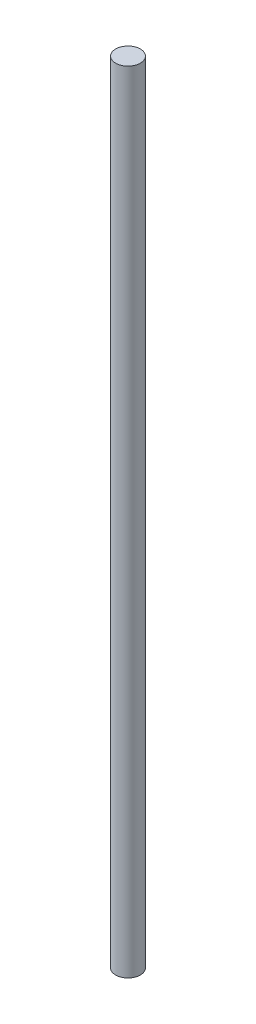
ISO-10303-21;
HEADER;
FILE_DESCRIPTION(('STEP AP214'),'2;1');
FILE_NAME('part.step','',(''),(''),'','','');
FILE_SCHEMA(('AUTOMOTIVE_DESIGN { 1 0 10303 214 1 1 1 1 }'));
ENDSEC;
DATA;
#1=APPLICATION_CONTEXT('core data for automotive mechanical design processes');
#2=APPLICATION_PROTOCOL_DEFINITION('international standard','automotive_design',2000,#1);
#3=PRODUCT_CONTEXT('',#1,'mechanical');
#4=PRODUCT('Part','Part','',(#3));
#5=PRODUCT_RELATED_PRODUCT_CATEGORY('part','',(#4));
#6=PRODUCT_DEFINITION_FORMATION('','',#4);
#7=PRODUCT_DEFINITION_CONTEXT('part definition',#1,'design');
#8=PRODUCT_DEFINITION('design','',#6,#7);
#9=PRODUCT_DEFINITION_SHAPE('','',#8);
#10=(LENGTH_UNIT() NAMED_UNIT(*) SI_UNIT(.MILLI.,.METRE.));
#11=(NAMED_UNIT(*) PLANE_ANGLE_UNIT() SI_UNIT($,.RADIAN.));
#12=(NAMED_UNIT(*) SI_UNIT($,.STERADIAN.) SOLID_ANGLE_UNIT());
#13=UNCERTAINTY_MEASURE_WITH_UNIT(LENGTH_MEASURE(1.E-05),#10,'distance_accuracy_value','');
#14=(GEOMETRIC_REPRESENTATION_CONTEXT(3) GLOBAL_UNCERTAINTY_ASSIGNED_CONTEXT((#13)) GLOBAL_UNIT_ASSIGNED_CONTEXT((#10,
#11,#12)) REPRESENTATION_CONTEXT('',''));
#15=CARTESIAN_POINT('',(0.,0.,0.));
#16=DIRECTION('',(0.,0.,1.));
#17=DIRECTION('',(1.,0.,0.));
#18=AXIS2_PLACEMENT_3D('',#15,#16,#17);
#19=CARTESIAN_POINT('',(0.,160.,0.));
#20=DIRECTION('',(0.,-1.,0.));
#21=DIRECTION('',(0.,0.,-1.));
#22=AXIS2_PLACEMENT_3D('',#19,#20,#21);
#23=CYLINDRICAL_SURFACE('',#22,2.5);
#24=CARTESIAN_POINT('',(0.,160.,0.));
#25=DIRECTION('',(0.,1.,0.));
#26=DIRECTION('',(0.,0.,1.));
#27=AXIS2_PLACEMENT_3D('',#24,#25,#26);
#28=CIRCLE('',#27,2.5);
#29=CARTESIAN_POINT('',(0.,160.,2.5));
#30=VERTEX_POINT('',#29);
#31=EDGE_CURVE('E10',#30,#30,#28,.T.);
#32=ORIENTED_EDGE('',*,*,#31,.F.);
#33=EDGE_LOOP('',(#32));
#34=FACE_BOUND('',#33,.T.);
#35=CARTESIAN_POINT('',(0.,0.,0.));
#36=DIRECTION('',(0.,1.,0.));
#37=DIRECTION('',(0.,0.,1.));
#38=AXIS2_PLACEMENT_3D('',#35,#36,#37);
#39=CIRCLE('',#38,2.5);
#40=CARTESIAN_POINT('',(0.,0.,2.5));
#41=VERTEX_POINT('',#40);
#42=EDGE_CURVE('E34',#41,#41,#39,.T.);
#43=ORIENTED_EDGE('',*,*,#42,.T.);
#44=EDGE_LOOP('',(#43));
#45=FACE_BOUND('',#44,.T.);
#46=ADVANCED_FACE('F31',(#34,#45),#23,.T.);
#47=CARTESIAN_POINT('',(0.,160.,0.));
#48=DIRECTION('',(0.,1.,0.));
#49=DIRECTION('',(0.,0.,1.));
#50=AXIS2_PLACEMENT_3D('',#47,#48,#49);
#51=PLANE('',#50);
#52=ORIENTED_EDGE('',*,*,#31,.T.);
#53=EDGE_LOOP('',(#52));
#54=FACE_BOUND('',#53,.T.);
#55=ADVANCED_FACE('F46',(#54),#51,.T.);
#56=CARTESIAN_POINT('',(0.,0.,0.));
#57=DIRECTION('',(0.,1.,0.));
#58=DIRECTION('',(0.,0.,1.));
#59=AXIS2_PLACEMENT_3D('',#56,#57,#58);
#60=PLANE('',#59);
#61=ORIENTED_EDGE('',*,*,#42,.F.);
#62=EDGE_LOOP('',(#61));
#63=FACE_BOUND('',#62,.T.);
#64=ADVANCED_FACE('F44',(#63),#60,.F.);
#65=CLOSED_SHELL('',(#46,#55,#64));
#66=MANIFOLD_SOLID_BREP('B2',#65);
#67=ADVANCED_BREP_SHAPE_REPRESENTATION('',(#18,#66),#14);
#68=SHAPE_DEFINITION_REPRESENTATION(#9,#67);
ENDSEC;
END-ISO-10303-21;
